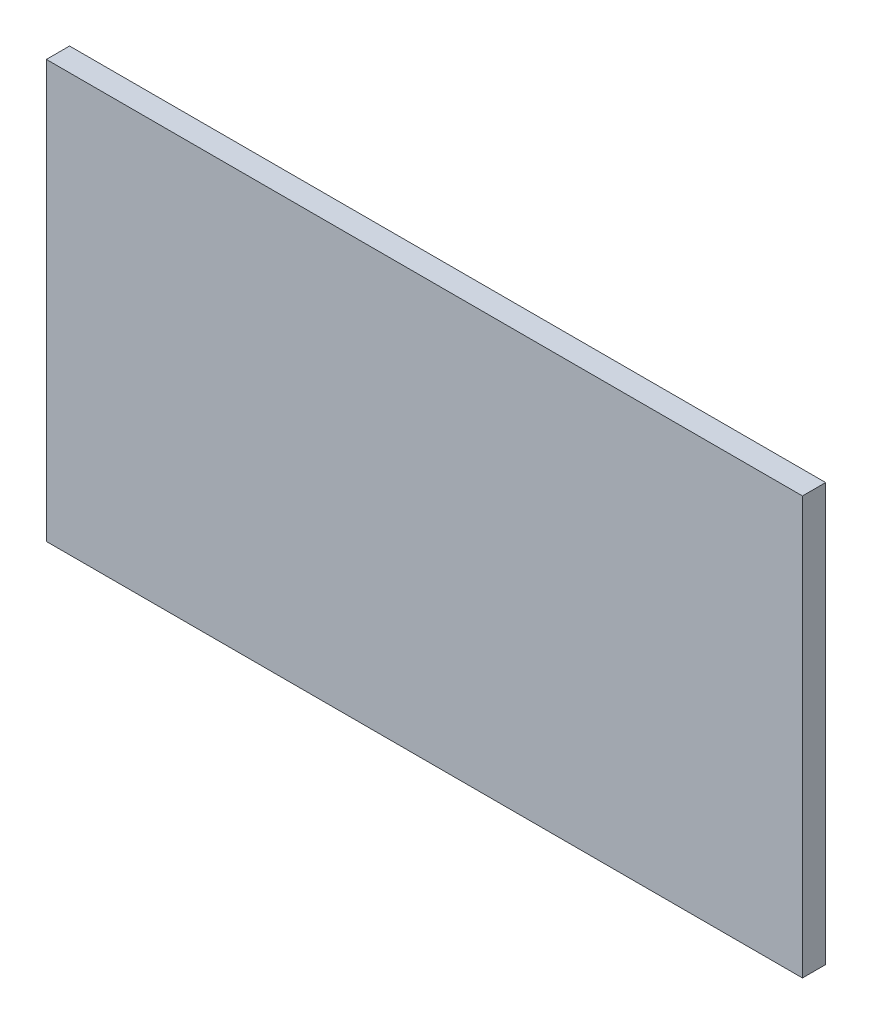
ISO-10303-21;
HEADER;
FILE_DESCRIPTION(('STEP AP214'),'2;1');
FILE_NAME('part.step','',(''),(''),'','','');
FILE_SCHEMA(('AUTOMOTIVE_DESIGN { 1 0 10303 214 1 1 1 1 }'));
ENDSEC;
DATA;
#1=APPLICATION_CONTEXT('core data for automotive mechanical design processes');
#2=APPLICATION_PROTOCOL_DEFINITION('international standard','automotive_design',2000,#1);
#3=PRODUCT_CONTEXT('',#1,'mechanical');
#4=PRODUCT('Part','Part','',(#3));
#5=PRODUCT_RELATED_PRODUCT_CATEGORY('part','',(#4));
#6=PRODUCT_DEFINITION_FORMATION('','',#4);
#7=PRODUCT_DEFINITION_CONTEXT('part definition',#1,'design');
#8=PRODUCT_DEFINITION('design','',#6,#7);
#9=PRODUCT_DEFINITION_SHAPE('','',#8);
#10=(LENGTH_UNIT() NAMED_UNIT(*) SI_UNIT(.MILLI.,.METRE.));
#11=(NAMED_UNIT(*) PLANE_ANGLE_UNIT() SI_UNIT($,.RADIAN.));
#12=(NAMED_UNIT(*) SI_UNIT($,.STERADIAN.) SOLID_ANGLE_UNIT());
#13=UNCERTAINTY_MEASURE_WITH_UNIT(LENGTH_MEASURE(1.E-05),#10,'distance_accuracy_value','');
#14=(GEOMETRIC_REPRESENTATION_CONTEXT(3) GLOBAL_UNCERTAINTY_ASSIGNED_CONTEXT((#13)) GLOBAL_UNIT_ASSIGNED_CONTEXT((#10,
#11,#12)) REPRESENTATION_CONTEXT('',''));
#15=CARTESIAN_POINT('',(0.,0.,0.));
#16=DIRECTION('',(0.,0.,1.));
#17=DIRECTION('',(1.,0.,0.));
#18=AXIS2_PLACEMENT_3D('',#15,#16,#17);
#19=CARTESIAN_POINT('',(0.,0.,-100.));
#20=DIRECTION('',(1.,0.,0.));
#21=DIRECTION('',(0.,0.,-1.));
#22=AXIS2_PLACEMENT_3D('',#19,#20,#21);
#23=PLANE('',#22);
#24=DIRECTION('',(0.,1.,0.));
#25=VECTOR('',#24,1.);
#26=CARTESIAN_POINT('',(0.,0.,0.));
#27=LINE('',#26,#25);
#28=CARTESIAN_POINT('',(0.,0.,0.));
#29=VERTEX_POINT('',#28);
#30=CARTESIAN_POINT('',(0.,1800.,0.));
#31=VERTEX_POINT('',#30);
#32=EDGE_CURVE('E99',#29,#31,#27,.T.);
#33=ORIENTED_EDGE('',*,*,#32,.F.);
#34=DIRECTION('',(0.,0.,1.));
#35=VECTOR('',#34,1.);
#36=CARTESIAN_POINT('',(0.,0.,-100.));
#37=LINE('',#36,#35);
#38=CARTESIAN_POINT('',(0.,0.,-100.));
#39=VERTEX_POINT('',#38);
#40=EDGE_CURVE('E11',#39,#29,#37,.T.);
#41=ORIENTED_EDGE('',*,*,#40,.F.);
#42=DIRECTION('',(0.,1.,0.));
#43=VECTOR('',#42,1.);
#44=CARTESIAN_POINT('',(0.,0.,-100.));
#45=LINE('',#44,#43);
#46=CARTESIAN_POINT('',(0.,1800.,-100.));
#47=VERTEX_POINT('',#46);
#48=EDGE_CURVE('E93',#39,#47,#45,.T.);
#49=ORIENTED_EDGE('',*,*,#48,.T.);
#50=DIRECTION('',(0.,0.,1.));
#51=VECTOR('',#50,1.);
#52=CARTESIAN_POINT('',(0.,1800.,-100.));
#53=LINE('',#52,#51);
#54=EDGE_CURVE('E38',#47,#31,#53,.T.);
#55=ORIENTED_EDGE('',*,*,#54,.T.);
#56=EDGE_LOOP('',(#33,#41,#49,#55));
#57=FACE_BOUND('',#56,.T.);
#58=ADVANCED_FACE('F35',(#57),#23,.T.);
#59=CARTESIAN_POINT('',(0.,0.,-100.));
#60=DIRECTION('',(0.,-1.,0.));
#61=DIRECTION('',(1.,0.,0.));
#62=AXIS2_PLACEMENT_3D('',#59,#60,#61);
#63=PLANE('',#62);
#64=DIRECTION('',(1.,0.,0.));
#65=VECTOR('',#64,1.);
#66=CARTESIAN_POINT('',(0.,0.,0.));
#67=LINE('',#66,#65);
#68=CARTESIAN_POINT('',(-3260.,-3.99234856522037E-13,0.));
#69=VERTEX_POINT('',#68);
#70=EDGE_CURVE('E95',#69,#29,#67,.T.);
#71=ORIENTED_EDGE('',*,*,#70,.F.);
#72=DIRECTION('',(0.,0.,1.));
#73=VECTOR('',#72,1.);
#74=CARTESIAN_POINT('',(-3260.,-3.99234856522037E-13,-100.));
#75=LINE('',#74,#73);
#76=CARTESIAN_POINT('',(-3260.,-3.99234856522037E-13,-100.));
#77=VERTEX_POINT('',#76);
#78=EDGE_CURVE('E44',#77,#69,#75,.T.);
#79=ORIENTED_EDGE('',*,*,#78,.F.);
#80=DIRECTION('',(1.,0.,0.));
#81=VECTOR('',#80,1.);
#82=CARTESIAN_POINT('',(0.,0.,-100.));
#83=LINE('',#82,#81);
#84=EDGE_CURVE('E90',#77,#39,#83,.T.);
#85=ORIENTED_EDGE('',*,*,#84,.T.);
#86=ORIENTED_EDGE('',*,*,#40,.T.);
#87=EDGE_LOOP('',(#71,#79,#85,#86));
#88=FACE_BOUND('',#87,.T.);
#89=ADVANCED_FACE('F109',(#88),#63,.T.);
#90=CARTESIAN_POINT('',(-3260.,-3.99234856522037E-13,-100.));
#91=DIRECTION('',(-1.,0.,0.));
#92=DIRECTION('',(0.,0.,1.));
#93=AXIS2_PLACEMENT_3D('',#90,#91,#92);
#94=PLANE('',#93);
#95=DIRECTION('',(0.,-1.,0.));
#96=VECTOR('',#95,1.);
#97=CARTESIAN_POINT('',(-3260.,-3.99234856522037E-13,0.));
#98=LINE('',#97,#96);
#99=CARTESIAN_POINT('',(-3260.,1800.,0.));
#100=VERTEX_POINT('',#99);
#101=EDGE_CURVE('E85',#100,#69,#98,.T.);
#102=ORIENTED_EDGE('',*,*,#101,.F.);
#103=DIRECTION('',(0.,0.,1.));
#104=VECTOR('',#103,1.);
#105=CARTESIAN_POINT('',(-3260.,1800.,-100.));
#106=LINE('',#105,#104);
#107=CARTESIAN_POINT('',(-3260.,1800.,-100.));
#108=VERTEX_POINT('',#107);
#109=EDGE_CURVE('E80',#108,#100,#106,.T.);
#110=ORIENTED_EDGE('',*,*,#109,.F.);
#111=DIRECTION('',(0.,-1.,0.));
#112=VECTOR('',#111,1.);
#113=CARTESIAN_POINT('',(-3260.,-3.99234856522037E-13,-100.));
#114=LINE('',#113,#112);
#115=EDGE_CURVE('E83',#108,#77,#114,.T.);
#116=ORIENTED_EDGE('',*,*,#115,.T.);
#117=ORIENTED_EDGE('',*,*,#78,.T.);
#118=EDGE_LOOP('',(#102,#110,#116,#117));
#119=FACE_BOUND('',#118,.T.);
#120=ADVANCED_FACE('F82',(#119),#94,.T.);
#121=CARTESIAN_POINT('',(0.,1800.,-100.));
#122=DIRECTION('',(0.,1.,0.));
#123=DIRECTION('',(-1.,0.,0.));
#124=AXIS2_PLACEMENT_3D('',#121,#122,#123);
#125=PLANE('',#124);
#126=DIRECTION('',(-1.,0.,0.));
#127=VECTOR('',#126,1.);
#128=CARTESIAN_POINT('',(0.,1800.,0.));
#129=LINE('',#128,#127);
#130=EDGE_CURVE('E102',#31,#100,#129,.T.);
#131=ORIENTED_EDGE('',*,*,#130,.F.);
#132=ORIENTED_EDGE('',*,*,#54,.F.);
#133=DIRECTION('',(-1.,0.,0.));
#134=VECTOR('',#133,1.);
#135=CARTESIAN_POINT('',(0.,1800.,-100.));
#136=LINE('',#135,#134);
#137=EDGE_CURVE('E89',#47,#108,#136,.T.);
#138=ORIENTED_EDGE('',*,*,#137,.T.);
#139=ORIENTED_EDGE('',*,*,#109,.T.);
#140=EDGE_LOOP('',(#131,#132,#138,#139));
#141=FACE_BOUND('',#140,.T.);
#142=ADVANCED_FACE('F92',(#141),#125,.T.);
#143=CARTESIAN_POINT('',(0.,0.,-100.));
#144=DIRECTION('',(0.,0.,1.));
#145=DIRECTION('',(1.,0.,0.));
#146=AXIS2_PLACEMENT_3D('',#143,#144,#145);
#147=PLANE('',#146);
#148=ORIENTED_EDGE('',*,*,#48,.F.);
#149=ORIENTED_EDGE('',*,*,#84,.F.);
#150=ORIENTED_EDGE('',*,*,#115,.F.);
#151=ORIENTED_EDGE('',*,*,#137,.F.);
#152=EDGE_LOOP('',(#148,#149,#150,#151));
#153=FACE_BOUND('',#152,.T.);
#154=ADVANCED_FACE('F88',(#153),#147,.F.);
#155=CARTESIAN_POINT('',(0.,0.,0.));
#156=DIRECTION('',(0.,0.,1.));
#157=DIRECTION('',(1.,0.,0.));
#158=AXIS2_PLACEMENT_3D('',#155,#156,#157);
#159=PLANE('',#158);
#160=ORIENTED_EDGE('',*,*,#32,.T.);
#161=ORIENTED_EDGE('',*,*,#130,.T.);
#162=ORIENTED_EDGE('',*,*,#101,.T.);
#163=ORIENTED_EDGE('',*,*,#70,.T.);
#164=EDGE_LOOP('',(#160,#161,#162,#163));
#165=FACE_BOUND('',#164,.T.);
#166=ADVANCED_FACE('F108',(#165),#159,.T.);
#167=CLOSED_SHELL('',(#58,#89,#120,#142,#154,#166));
#168=MANIFOLD_SOLID_BREP('B2',#167);
#169=ADVANCED_BREP_SHAPE_REPRESENTATION('',(#18,#168),#14);
#170=SHAPE_DEFINITION_REPRESENTATION(#9,#169);
ENDSEC;
END-ISO-10303-21;
